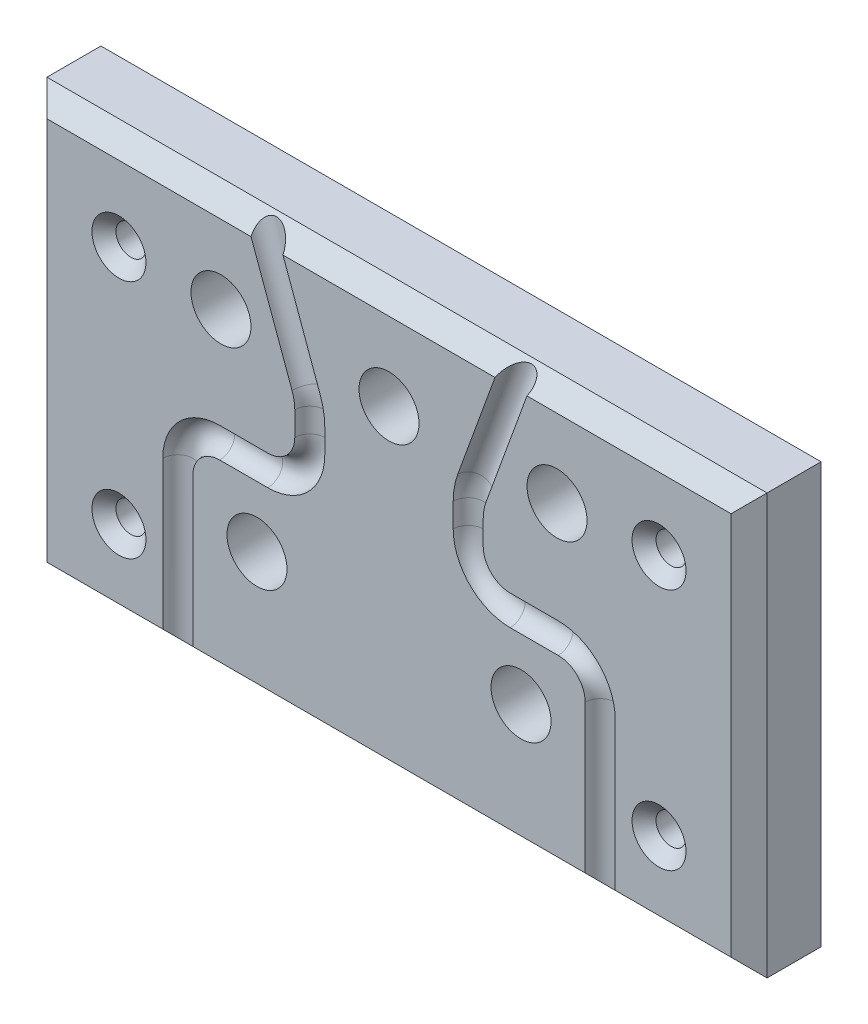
from build123d import *

# Parameters (mm, degrees)
ESQUISSE1_W                                    = 120
ESQUISSE1_H                                    = 70
BASE_EXTRUSION_DEPTH                           = 12
CHANFREIN1_SIZE                                = 3
FRAISAGE_POUR_VIS_T_TE_FRAIS_E_M21_D           = 5
FRAISAGE_POUR_VIS_T_TE_FRAIS_E_M21_CSINK_D     = 9
FRAISAGE_POUR_VIS_T_TE_FRAIS_E_M21_CSINK_ANGLE = 90
ESQUISSE17_R                                   = 2.5
ENL_V_MAT_EXTRU_4_DEPTH                        = 27.65
ESQUISSE18_R                                   = 2.5
ENL_VEMENT_DE_MATI_RE_R_VOLUTION2_ANGLE        = 90
ESQUISSE19_R                                   = 2.5
ENL_V_MAT_EXTRU_5_DEPTH                        = 8
ESQUISSE20_R                                   = 2.5
ENL_VEMENT_DE_MATI_RE_R_VOLUTION3_ANGLE        = 90
ESQUISSE21_R                                   = 2.5
ENL_V_MAT_EXTRU_6_DEPTH                        = 4
ESQUISSE22_R                                   = 2.5
ENL_VEMENT_DE_MATI_RE_R_VOLUTION4_ANGLE        = 20
ESQUISSE23_R                                   = 2.5
ENL_V_MAT_EXTRU_7_DEPTH                        = 89.259978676
ESQUISSE24_R                                   = 5
ENL_V_MAT_EXTRU_8_DEPTH                        = 18


with BuildPart() as part:
    # Esquisse1 → Base-Extrusion (new body)
    with BuildSketch(Plane.XY):
        with Locations((0, 17.928393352)):
            Rectangle(ESQUISSE1_W, ESQUISSE1_H)
    extrude(amount=BASE_EXTRUSION_DEPTH)

    # Chanfrein1
    chanfrein1_edges = [part.edges().sort_by_distance(p)[0] for p in [
        (60, 17.928393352, 12),
        (0, 52.928393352, 12),
        (-60, 17.928393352, 12),
        (0, -17.071606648, 12),
    ]]
    chamfer(chanfrein1_edges, length=CHANFREIN1_SIZE)

    # Fraisage pour vis _ t_te frais_e M21 (through all)
    with Locations(Plane.XY.offset(12)):
        with Locations((-45, 37.428393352), (45, 37.928393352), (45, -2.571606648), (-45, -2.571606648)):
            CounterSinkHole(FRAISAGE_POUR_VIS_T_TE_FRAIS_E_M21_D / 2, FRAISAGE_POUR_VIS_T_TE_FRAIS_E_M21_CSINK_D / 2, counter_sink_angle=FRAISAGE_POUR_VIS_T_TE_FRAIS_E_M21_CSINK_ANGLE)

    # Esquisse17 → Enl_v. mat.-Extru.4 (cut)
    with BuildSketch(Plane.XZ.offset(17.071606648)):
        with Locations((35.2, 12)):
            Circle(ESQUISSE17_R)
    enl_v_mat_extru_4 = extrude(amount=-ENL_V_MAT_EXTRU_4_DEPTH, mode=Mode.SUBTRACT)

    # Esquisse18 → Enl_vement de mati_re-R_volution2 (revolve, cut)
    with BuildSketch(Plane.XZ.offset(-10.578393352)):
        with Locations((35.2, 12)):
            Circle(ESQUISSE18_R)
    enl_vement_de_mati_re_r_volution2 = revolve(axis=Axis((28.2, 10.578393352, 17.569111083), (0, 0, 1)), revolution_arc=ENL_VEMENT_DE_MATI_RE_R_VOLUTION2_ANGLE, mode=Mode.SUBTRACT)

    # Esquisse19 → Enl_v. mat.-Extru.5 (cut)
    with BuildSketch(Plane(origin=(28.2, 0, 0), x_dir=(0, 0, -1), z_dir=(1, 0, 0))):
        with Locations((-12, 17.578393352)):
            Circle(ESQUISSE19_R)
    enl_v_mat_extru_5 = extrude(amount=-ENL_V_MAT_EXTRU_5_DEPTH, mode=Mode.SUBTRACT)

    # Esquisse20 → Enl_vement de mati_re-R_volution3 (revolve, cut)
    with BuildSketch(Plane(origin=(20.2, 0, 0), x_dir=(0, 0, -1), z_dir=(1, 0, 0))):
        with Locations((-12, 17.578393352)):
            Circle(ESQUISSE20_R)
    enl_vement_de_mati_re_r_volution3 = revolve(axis=Axis((20.2, 24.578393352, 15.867757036), (0, 0, -1)), revolution_arc=ENL_VEMENT_DE_MATI_RE_R_VOLUTION3_ANGLE, mode=Mode.SUBTRACT)

    # Esquisse21 → Enl_v. mat.-Extru.6 (cut)
    with BuildSketch(Plane.XZ.offset(-24.578393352)):
        with Locations((13.2, 12)):
            Circle(ESQUISSE21_R)
    enl_v_mat_extru_6 = extrude(amount=-ENL_V_MAT_EXTRU_6_DEPTH, mode=Mode.SUBTRACT)

    # Esquisse22 → Enl_vement de mati_re-R_volution4 (revolve, cut)
    with BuildSketch(Plane.XZ.offset(-28.578393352)):
        with Locations((13.2, 12)):
            Circle(ESQUISSE22_R)
    enl_vement_de_mati_re_r_volution4 = revolve(axis=Axis((23.2, 28.578393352, 17.956972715), (0, 0, -1)), revolution_arc=ENL_VEMENT_DE_MATI_RE_R_VOLUTION4_ANGLE, mode=Mode.SUBTRACT)

    # Esquisse23 → Enl_v. mat.-Extru.7 (cut, through all)
    with BuildSketch(Plane(origin=(11.898803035, 32.691692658, 0), x_dir=(0.9396926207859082, -0.34202014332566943, 0), z_dir=(-0.34202014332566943, -0.9396926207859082, 0))):
        with Locations((2.026482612, 12)):
            Circle(ESQUISSE23_R)
    enl_v_mat_extru_7 = extrude(amount=-ENL_V_MAT_EXTRU_7_DEPTH, mode=Mode.SUBTRACT)

    # Sym_trie1: Enl_v. mat.-Extru.4, Enl_vement de mati_re-R_volution2, Enl_v. mat.-Extru.5, Enl_vement de mati_re-R_volution3, Enl_v. mat.-Extru.6, Enl_vement de mati_re-R_volution4, Enl_v. mat.-Extru.7 across plane
    add(enl_v_mat_extru_4.mirror(Plane(origin=(0, 0, 0), x_dir=(0, 0, 1), z_dir=(1, 0, 0))), mode=Mode.SUBTRACT)
    add(enl_vement_de_mati_re_r_volution2.mirror(Plane(origin=(0, 0, 0), x_dir=(0, 0, 1), z_dir=(1, 0, 0))), mode=Mode.SUBTRACT)
    add(enl_v_mat_extru_5.mirror(Plane(origin=(0, 0, 0), x_dir=(0, 0, 1), z_dir=(1, 0, 0))), mode=Mode.SUBTRACT)
    add(enl_vement_de_mati_re_r_volution3.mirror(Plane(origin=(0, 0, 0), x_dir=(0, 0, 1), z_dir=(1, 0, 0))), mode=Mode.SUBTRACT)
    add(enl_v_mat_extru_6.mirror(Plane(origin=(0, 0, 0), x_dir=(0, 0, 1), z_dir=(1, 0, 0))), mode=Mode.SUBTRACT)
    add(enl_vement_de_mati_re_r_volution4.mirror(Plane(origin=(0, 0, 0), x_dir=(0, 0, 1), z_dir=(1, 0, 0))), mode=Mode.SUBTRACT)
    add(enl_v_mat_extru_7.mirror(Plane(origin=(0, 0, 0), x_dir=(0, 0, 1), z_dir=(1, 0, 0))), mode=Mode.SUBTRACT)

    # Esquisse24 → Enl_v. mat.-Extru.8 (cut)
    with BuildSketch(Plane.XY.offset(12)):
        with Locations((-28, 36.928393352)):
            Circle(ESQUISSE24_R)
        with Locations((28, 36.928393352)):
            Circle(ESQUISSE24_R)
        with Locations((-22, 4.928393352)):
            Circle(ESQUISSE24_R)
        with Locations((22, 4.928393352)):
            Circle(ESQUISSE24_R)
        with Locations((0, 36.928393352)):
            Circle(ESQUISSE24_R)
    extrude(amount=-ENL_V_MAT_EXTRU_8_DEPTH, mode=Mode.SUBTRACT)


solid = part.part
